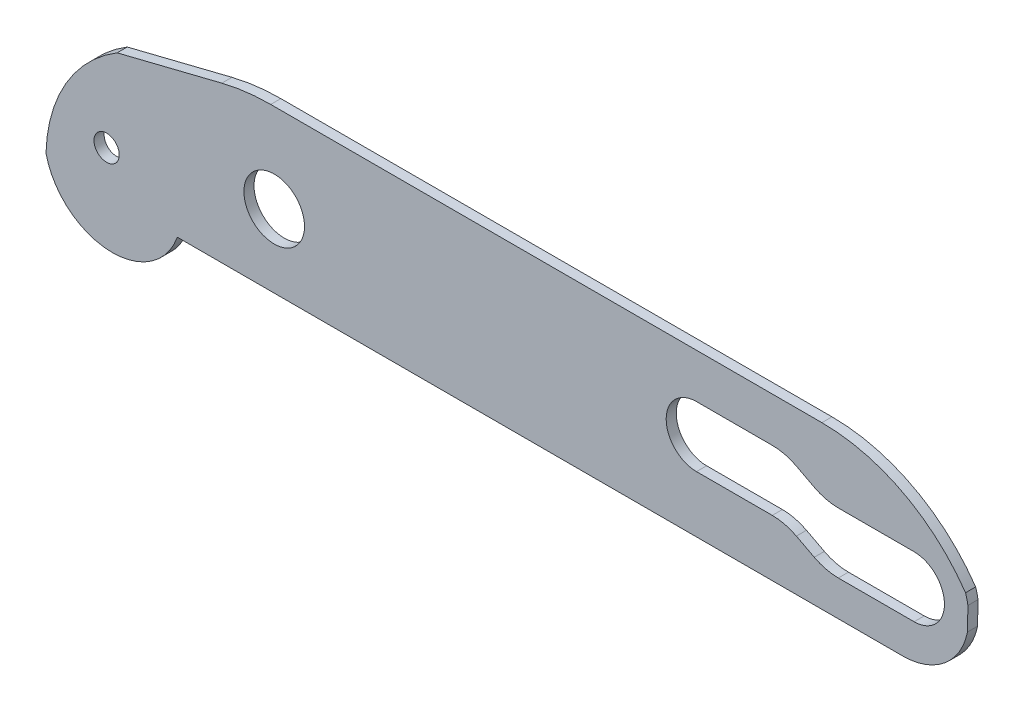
from build123d import *

# Parameters (mm, degrees)
ESQUISSE1_R             = 3
ESQUISSE1_R_2           = 1.25
BASE_EXTRUSION_DEPTH    = 1
ENL_V_MAT_EXTRU_1_DEPTH = 1


with BuildPart() as part:
    # Esquisse1 → Base-Extrusion (new body)
    with BuildSketch(Plane.XY):
        with BuildLine():
            Line((0, 0), (71.783819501, 0))
            ThreePointArc((71.783819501, 0), (75.927856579, 1.483431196), (78.189077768, 5.259737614))
            Line((78.189077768, 5.259737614), (78.231963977, 7.560695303))
            ThreePointArc((78.231963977, 7.560695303), (78.134502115, 8.049779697), (78, 8.53))
            ThreePointArc((78, 8.53), (71.81346283, 14.018810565), (63.783819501, 16))
            Line((63.783819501, 16), (9.239510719, 16))
            ThreePointArc((9.239510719, 16), (6.802123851, 15.850923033), (4.401072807, 15.405914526))
            Line((4.401072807, 15.405914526), (-5.959545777, 12.822722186))
            ThreePointArc((-5.959545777, 12.822722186), (-11.030166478, 7.665573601), (-13, 0.706613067))
            ThreePointArc((-13, 0.706613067), (-10.972209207, -2.784937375), (-7.307055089, -4.478898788))
            ThreePointArc((-7.307055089, -4.478898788), (-2.865156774, -3.525629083), (0, 0))
        make_face()
        with Locations((9.583819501, 7.21)):
            Circle(ESQUISSE1_R, mode=Mode.SUBTRACT)
        with Locations((-7, 4.17)):
            Circle(ESQUISSE1_R_2, mode=Mode.SUBTRACT)
    extrude(amount=BASE_EXTRUSION_DEPTH)

    # Esquisse2 → Enl_v. mat.-Extru.1 (cut)
    with BuildSketch(Plane.XY.offset(1)):
        with BuildLine():
            Line((61.255988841, 11.013264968), (63.028003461, 10.085922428))
            ThreePointArc((63.028003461, 10.085922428), (64.184154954, 9.648629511), (65.411273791, 9.5))
            Line((65.411273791, 9.5), (72.911273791, 9.5))
            ThreePointArc((72.911273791, 9.5), (75.911273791, 6.5), (72.911273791, 3.5))
            Line((72.911273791, 3.5), (65.411273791, 3.5))
            ThreePointArc((65.411273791, 3.5), (64.184154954, 3.648629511), (63.028003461, 4.085922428))
            Line((63.028003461, 4.085922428), (61.255988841, 5.013264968))
            ThreePointArc((61.255988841, 5.013264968), (60.099837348, 5.450557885), (58.872718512, 5.599187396))
            Line((58.872718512, 5.599187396), (51.372718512, 5.599187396))
            ThreePointArc((51.372718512, 5.599187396), (48.372718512, 8.599187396), (51.372718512, 11.599187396))
            Line((51.372718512, 11.599187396), (58.872718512, 11.599187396))
            ThreePointArc((58.872718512, 11.599187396), (60.099837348, 11.450557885), (61.255988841, 11.013264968))
        make_face()
    extrude(amount=-ENL_V_MAT_EXTRU_1_DEPTH, mode=Mode.SUBTRACT)


solid = part.part
